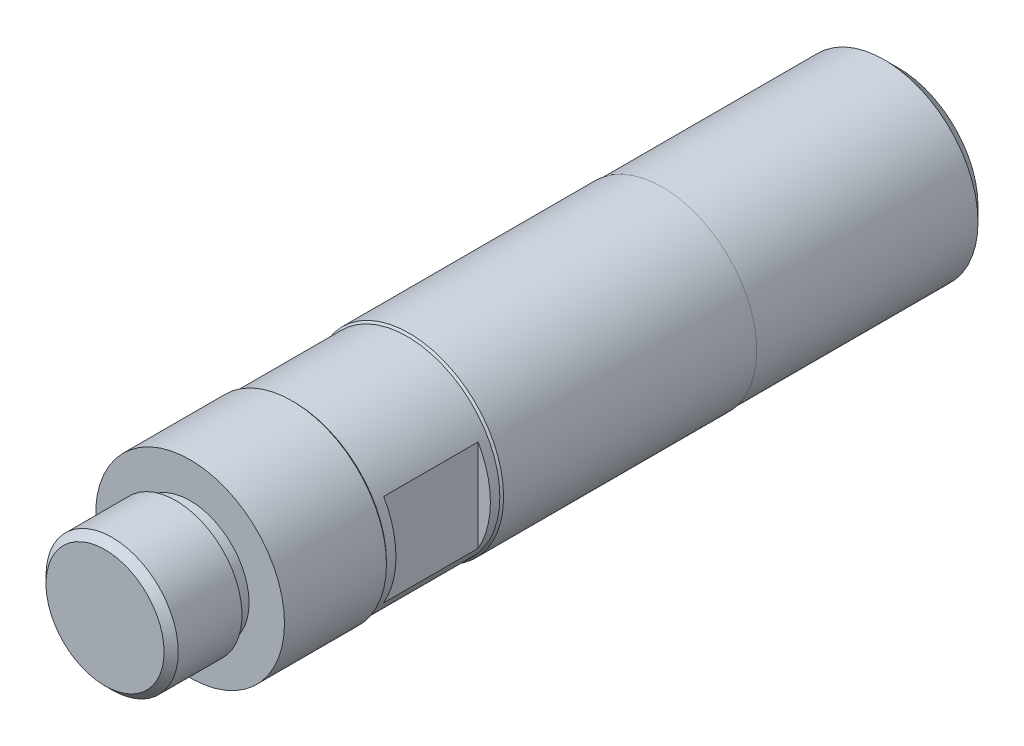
ISO-10303-21;
HEADER;
FILE_DESCRIPTION(('STEP AP214'),'2;1');
FILE_NAME('part.step','',(''),(''),'','','');
FILE_SCHEMA(('AUTOMOTIVE_DESIGN { 1 0 10303 214 1 1 1 1 }'));
ENDSEC;
DATA;
#1=APPLICATION_CONTEXT('core data for automotive mechanical design processes');
#2=APPLICATION_PROTOCOL_DEFINITION('international standard','automotive_design',2000,#1);
#3=PRODUCT_CONTEXT('',#1,'mechanical');
#4=PRODUCT('Part','Part','',(#3));
#5=PRODUCT_RELATED_PRODUCT_CATEGORY('part','',(#4));
#6=PRODUCT_DEFINITION_FORMATION('','',#4);
#7=PRODUCT_DEFINITION_CONTEXT('part definition',#1,'design');
#8=PRODUCT_DEFINITION('design','',#6,#7);
#9=PRODUCT_DEFINITION_SHAPE('','',#8);
#10=(LENGTH_UNIT() NAMED_UNIT(*) SI_UNIT(.MILLI.,.METRE.));
#11=(NAMED_UNIT(*) PLANE_ANGLE_UNIT() SI_UNIT($,.RADIAN.));
#12=(NAMED_UNIT(*) SI_UNIT($,.STERADIAN.) SOLID_ANGLE_UNIT());
#13=UNCERTAINTY_MEASURE_WITH_UNIT(LENGTH_MEASURE(1.E-05),#10,'distance_accuracy_value','');
#14=(GEOMETRIC_REPRESENTATION_CONTEXT(3) GLOBAL_UNCERTAINTY_ASSIGNED_CONTEXT((#13)) GLOBAL_UNIT_ASSIGNED_CONTEXT((#10,
#11,#12)) REPRESENTATION_CONTEXT('',''));
#15=CARTESIAN_POINT('',(0.,0.,0.));
#16=DIRECTION('',(0.,0.,1.));
#17=DIRECTION('',(1.,0.,0.));
#18=AXIS2_PLACEMENT_3D('',#15,#16,#17);
#19=CARTESIAN_POINT('',(0.,0.,75.));
#20=DIRECTION('',(0.,0.,-1.));
#21=DIRECTION('',(-1.,0.,0.));
#22=AXIS2_PLACEMENT_3D('',#19,#20,#21);
#23=CYLINDRICAL_SURFACE('',#22,10.);
#24=CARTESIAN_POINT('',(0.,0.,51.8));
#25=DIRECTION('',(0.,0.,1.));
#26=DIRECTION('',(1.,0.,0.));
#27=AXIS2_PLACEMENT_3D('',#24,#25,#26);
#28=CIRCLE('',#27,10.);
#29=CARTESIAN_POINT('',(10.,0.,51.8));
#30=VERTEX_POINT('',#29);
#31=EDGE_CURVE('E243',#30,#30,#28,.T.);
#32=ORIENTED_EDGE('',*,*,#31,.F.);
#33=EDGE_LOOP('',(#32));
#34=FACE_BOUND('',#33,.T.);
#35=CARTESIAN_POINT('',(0.,0.,25.));
#36=DIRECTION('',(0.,0.,1.));
#37=DIRECTION('',(1.,0.,0.));
#38=AXIS2_PLACEMENT_3D('',#35,#36,#37);
#39=CIRCLE('',#38,10.);
#40=CARTESIAN_POINT('',(10.,0.,25.));
#41=VERTEX_POINT('',#40);
#42=EDGE_CURVE('E251',#41,#41,#39,.T.);
#43=ORIENTED_EDGE('',*,*,#42,.T.);
#44=EDGE_LOOP('',(#43));
#45=FACE_BOUND('',#44,.T.);
#46=ADVANCED_FACE('F42',(#34,#45),#23,.T.);
#47=CARTESIAN_POINT('',(0.,0.,75.));
#48=DIRECTION('',(0.,0.,1.));
#49=DIRECTION('',(1.,0.,0.));
#50=AXIS2_PLACEMENT_3D('',#47,#48,#49);
#51=CIRCLE('',#50,10.);
#52=CARTESIAN_POINT('',(10.,0.,75.));
#53=VERTEX_POINT('',#52);
#54=EDGE_CURVE('E104',#53,#53,#51,.T.);
#55=ORIENTED_EDGE('',*,*,#54,.F.);
#56=EDGE_LOOP('',(#55));
#57=FACE_BOUND('',#56,.T.);
#58=CARTESIAN_POINT('',(0.,0.,64.2));
#59=DIRECTION('',(0.,0.,1.));
#60=DIRECTION('',(1.,0.,0.));
#61=AXIS2_PLACEMENT_3D('',#58,#59,#60);
#62=CIRCLE('',#61,10.);
#63=CARTESIAN_POINT('',(10.,0.,64.2));
#64=VERTEX_POINT('',#63);
#65=EDGE_CURVE('E100',#64,#64,#62,.T.);
#66=ORIENTED_EDGE('',*,*,#65,.T.);
#67=EDGE_LOOP('',(#66));
#68=FACE_BOUND('',#67,.T.);
#69=ADVANCED_FACE('F146',(#57,#68),#23,.T.);
#70=CARTESIAN_POINT('',(0.,0.,84.));
#71=DIRECTION('',(0.,0.,-1.));
#72=DIRECTION('',(-1.,0.,0.));
#73=AXIS2_PLACEMENT_3D('',#70,#71,#72);
#74=CYLINDRICAL_SURFACE('',#73,7.);
#75=CARTESIAN_POINT('',(0.,0.,83.25));
#76=DIRECTION('',(0.,0.,1.));
#77=DIRECTION('',(1.,0.,0.));
#78=AXIS2_PLACEMENT_3D('',#75,#76,#77);
#79=CIRCLE('',#78,7.);
#80=CARTESIAN_POINT('',(7.,0.,83.25));
#81=VERTEX_POINT('',#80);
#82=EDGE_CURVE('E93',#81,#81,#79,.F.);
#83=ORIENTED_EDGE('',*,*,#82,.T.);
#84=EDGE_LOOP('',(#83));
#85=FACE_BOUND('',#84,.T.);
#86=CARTESIAN_POINT('',(0.,0.,76.5));
#87=DIRECTION('',(0.,0.,-1.));
#88=DIRECTION('',(-1.,0.,0.));
#89=AXIS2_PLACEMENT_3D('',#86,#87,#88);
#90=CIRCLE('',#89,7.);
#91=CARTESIAN_POINT('',(-7.,0.,76.5));
#92=VERTEX_POINT('',#91);
#93=EDGE_CURVE('E122',#92,#92,#90,.T.);
#94=ORIENTED_EDGE('',*,*,#93,.F.);
#95=EDGE_LOOP('',(#94));
#96=FACE_BOUND('',#95,.T.);
#97=ADVANCED_FACE('F152',(#85,#96),#74,.T.);
#98=CARTESIAN_POINT('',(0.,0.,84.));
#99=DIRECTION('',(0.,0.,1.));
#100=DIRECTION('',(1.,0.,0.));
#101=AXIS2_PLACEMENT_3D('',#98,#99,#100);
#102=PLANE('',#101);
#103=CARTESIAN_POINT('',(0.,0.,84.));
#104=DIRECTION('',(0.,0.,1.));
#105=DIRECTION('',(1.,0.,0.));
#106=AXIS2_PLACEMENT_3D('',#103,#104,#105);
#107=CIRCLE('',#106,6.25);
#108=CARTESIAN_POINT('',(6.25,0.,84.));
#109=VERTEX_POINT('',#108);
#110=EDGE_CURVE('E110',#109,#109,#107,.T.);
#111=ORIENTED_EDGE('',*,*,#110,.T.);
#112=EDGE_LOOP('',(#111));
#113=FACE_BOUND('',#112,.T.);
#114=ADVANCED_FACE('F160',(#113),#102,.T.);
#115=CARTESIAN_POINT('',(0.,0.,84.));
#116=DIRECTION('',(0.,0.,-1.));
#117=DIRECTION('',(-1.,0.,0.));
#118=AXIS2_PLACEMENT_3D('',#115,#116,#117);
#119=CONICAL_SURFACE('',#118,6.25,0.785398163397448);
#120=ORIENTED_EDGE('',*,*,#82,.F.);
#121=EDGE_LOOP('',(#120));
#122=FACE_BOUND('',#121,.T.);
#123=ORIENTED_EDGE('',*,*,#110,.F.);
#124=EDGE_LOOP('',(#123));
#125=FACE_BOUND('',#124,.T.);
#126=ADVANCED_FACE('F157',(#122,#125),#119,.T.);
#127=CARTESIAN_POINT('',(-10.,0.,76.5));
#128=DIRECTION('',(0.,0.,-1.));
#129=DIRECTION('',(-1.,0.,0.));
#130=AXIS2_PLACEMENT_3D('',#127,#128,#129);
#131=PLANE('',#130);
#132=CARTESIAN_POINT('',(0.,0.,76.5));
#133=DIRECTION('',(0.,0.,1.));
#134=DIRECTION('',(1.,0.,0.));
#135=AXIS2_PLACEMENT_3D('',#132,#133,#134);
#136=CIRCLE('',#135,6.25);
#137=CARTESIAN_POINT('',(6.25,0.,76.5));
#138=VERTEX_POINT('',#137);
#139=EDGE_CURVE('E126',#138,#138,#136,.T.);
#140=ORIENTED_EDGE('',*,*,#139,.T.);
#141=EDGE_LOOP('',(#140));
#142=FACE_BOUND('',#141,.T.);
#143=ORIENTED_EDGE('',*,*,#93,.T.);
#144=EDGE_LOOP('',(#143));
#145=FACE_BOUND('',#144,.T.);
#146=ADVANCED_FACE('F159',(#142,#145),#131,.T.);
#147=CARTESIAN_POINT('',(0.,0.,83.9082113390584));
#148=DIRECTION('',(0.,0.,1.));
#149=DIRECTION('',(1.,0.,0.));
#150=AXIS2_PLACEMENT_3D('',#147,#148,#149);
#151=CYLINDRICAL_SURFACE('',#150,6.25);
#152=CARTESIAN_POINT('',(0.,0.,75.));
#153=DIRECTION('',(0.,0.,1.));
#154=DIRECTION('',(1.,0.,0.));
#155=AXIS2_PLACEMENT_3D('',#152,#153,#154);
#156=CIRCLE('',#155,6.25);
#157=CARTESIAN_POINT('',(6.25,0.,75.));
#158=VERTEX_POINT('',#157);
#159=EDGE_CURVE('E199',#158,#158,#156,.T.);
#160=ORIENTED_EDGE('',*,*,#159,.T.);
#161=EDGE_LOOP('',(#160));
#162=FACE_BOUND('',#161,.T.);
#163=ORIENTED_EDGE('',*,*,#139,.F.);
#164=EDGE_LOOP('',(#163));
#165=FACE_BOUND('',#164,.T.);
#166=ADVANCED_FACE('F166',(#162,#165),#151,.T.);
#167=CARTESIAN_POINT('',(0.,0.,75.));
#168=DIRECTION('',(0.,0.,1.));
#169=DIRECTION('',(1.,0.,0.));
#170=AXIS2_PLACEMENT_3D('',#167,#168,#169);
#171=PLANE('',#170);
#172=ORIENTED_EDGE('',*,*,#54,.T.);
#173=EDGE_LOOP('',(#172));
#174=FACE_BOUND('',#173,.T.);
#175=ORIENTED_EDGE('',*,*,#159,.F.);
#176=EDGE_LOOP('',(#175));
#177=FACE_BOUND('',#176,.T.);
#178=ADVANCED_FACE('F183',(#174,#177),#171,.T.);
#179=CARTESIAN_POINT('',(0.,0.,64.2));
#180=DIRECTION('',(0.,0.,1.));
#181=DIRECTION('',(1.,0.,0.));
#182=AXIS2_PLACEMENT_3D('',#179,#180,#181);
#183=CONICAL_SURFACE('',#182,10.,0.785398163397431);
#184=CARTESIAN_POINT('',(0.,0.,64.));
#185=DIRECTION('',(0.,0.,1.));
#186=DIRECTION('',(1.,0.,0.));
#187=AXIS2_PLACEMENT_3D('',#184,#185,#186);
#188=CIRCLE('',#187,9.8);
#189=CARTESIAN_POINT('',(9.8,0.,64.));
#190=VERTEX_POINT('',#189);
#191=EDGE_CURVE('E235',#190,#190,#188,.T.);
#192=ORIENTED_EDGE('',*,*,#191,.T.);
#193=EDGE_LOOP('',(#192));
#194=FACE_BOUND('',#193,.T.);
#195=ORIENTED_EDGE('',*,*,#65,.F.);
#196=EDGE_LOOP('',(#195));
#197=FACE_BOUND('',#196,.T.);
#198=ADVANCED_FACE('F185',(#194,#197),#183,.T.);
#199=CARTESIAN_POINT('',(0.,0.,84.));
#200=DIRECTION('',(0.,0.,1.));
#201=DIRECTION('',(1.,0.,0.));
#202=AXIS2_PLACEMENT_3D('',#199,#200,#201);
#203=CYLINDRICAL_SURFACE('',#202,9.8);
#204=DIRECTION('',(0.,0.,1.));
#205=VECTOR('',#204,1.);
#206=CARTESIAN_POINT('',(8.49999999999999,-4.8774993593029,84.));
#207=LINE('',#206,#205);
#208=CARTESIAN_POINT('',(8.49999999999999,-4.8774993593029,63.));
#209=VERTEX_POINT('',#208);
#210=CARTESIAN_POINT('',(8.49999999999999,-4.8774993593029,53.));
#211=VERTEX_POINT('',#210);
#212=EDGE_CURVE('E58',#209,#211,#207,.F.);
#213=ORIENTED_EDGE('',*,*,#212,.F.);
#214=CARTESIAN_POINT('',(0.,0.,63.));
#215=DIRECTION('',(0.,0.,-1.));
#216=DIRECTION('',(-1.,0.,0.));
#217=AXIS2_PLACEMENT_3D('',#214,#215,#216);
#218=CIRCLE('',#217,9.8);
#219=CARTESIAN_POINT('',(8.49999999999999,4.8774993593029,63.));
#220=VERTEX_POINT('',#219);
#221=EDGE_CURVE('E224',#220,#209,#218,.T.);
#222=ORIENTED_EDGE('',*,*,#221,.F.);
#223=DIRECTION('',(0.,0.,1.));
#224=VECTOR('',#223,1.);
#225=CARTESIAN_POINT('',(8.49999999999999,4.8774993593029,84.));
#226=LINE('',#225,#224);
#227=CARTESIAN_POINT('',(8.49999999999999,4.8774993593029,53.));
#228=VERTEX_POINT('',#227);
#229=EDGE_CURVE('E208',#228,#220,#226,.T.);
#230=ORIENTED_EDGE('',*,*,#229,.F.);
#231=CARTESIAN_POINT('',(0.,0.,53.));
#232=DIRECTION('',(0.,0.,1.));
#233=DIRECTION('',(1.,0.,0.));
#234=AXIS2_PLACEMENT_3D('',#231,#232,#233);
#235=CIRCLE('',#234,9.8);
#236=EDGE_CURVE('E201',#211,#228,#235,.T.);
#237=ORIENTED_EDGE('',*,*,#236,.F.);
#238=EDGE_LOOP('',(#213,#222,#230,#237));
#239=FACE_BOUND('',#238,.T.);
#240=CARTESIAN_POINT('',(0.,0.,53.));
#241=DIRECTION('',(0.,0.,1.));
#242=DIRECTION('',(1.,0.,0.));
#243=AXIS2_PLACEMENT_3D('',#240,#241,#242);
#244=CIRCLE('',#243,9.8);
#245=CARTESIAN_POINT('',(-8.49999999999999,4.8774993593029,53.));
#246=VERTEX_POINT('',#245);
#247=CARTESIAN_POINT('',(-8.49999999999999,-4.87749935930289,53.));
#248=VERTEX_POINT('',#247);
#249=EDGE_CURVE('E66',#246,#248,#244,.T.);
#250=ORIENTED_EDGE('',*,*,#249,.F.);
#251=DIRECTION('',(0.,0.,1.));
#252=VECTOR('',#251,1.);
#253=CARTESIAN_POINT('',(-8.49999999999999,4.8774993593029,84.));
#254=LINE('',#253,#252);
#255=CARTESIAN_POINT('',(-8.49999999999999,4.8774993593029,63.));
#256=VERTEX_POINT('',#255);
#257=EDGE_CURVE('E81',#256,#246,#254,.F.);
#258=ORIENTED_EDGE('',*,*,#257,.F.);
#259=CARTESIAN_POINT('',(0.,0.,63.));
#260=DIRECTION('',(0.,0.,-1.));
#261=DIRECTION('',(-1.,0.,0.));
#262=AXIS2_PLACEMENT_3D('',#259,#260,#261);
#263=CIRCLE('',#262,9.8);
#264=CARTESIAN_POINT('',(-8.49999999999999,-4.8774993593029,63.));
#265=VERTEX_POINT('',#264);
#266=EDGE_CURVE('E85',#265,#256,#263,.T.);
#267=ORIENTED_EDGE('',*,*,#266,.F.);
#268=DIRECTION('',(0.,0.,1.));
#269=VECTOR('',#268,1.);
#270=CARTESIAN_POINT('',(-8.49999999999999,-4.8774993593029,84.));
#271=LINE('',#270,#269);
#272=EDGE_CURVE('E92',#248,#265,#271,.T.);
#273=ORIENTED_EDGE('',*,*,#272,.F.);
#274=EDGE_LOOP('',(#250,#258,#267,#273));
#275=FACE_BOUND('',#274,.T.);
#276=CARTESIAN_POINT('',(0.,0.,52.));
#277=DIRECTION('',(0.,0.,1.));
#278=DIRECTION('',(1.,0.,0.));
#279=AXIS2_PLACEMENT_3D('',#276,#277,#278);
#280=CIRCLE('',#279,9.8);
#281=CARTESIAN_POINT('',(9.8,0.,52.));
#282=VERTEX_POINT('',#281);
#283=EDGE_CURVE('E239',#282,#282,#280,.T.);
#284=ORIENTED_EDGE('',*,*,#283,.T.);
#285=EDGE_LOOP('',(#284));
#286=FACE_BOUND('',#285,.T.);
#287=ORIENTED_EDGE('',*,*,#191,.F.);
#288=EDGE_LOOP('',(#287));
#289=FACE_BOUND('',#288,.T.);
#290=ADVANCED_FACE('F83',(#239,#275,#286,#289),#203,.T.);
#291=CARTESIAN_POINT('',(0.,0.,52.));
#292=DIRECTION('',(0.,0.,-1.));
#293=DIRECTION('',(-1.,0.,0.));
#294=AXIS2_PLACEMENT_3D('',#291,#292,#293);
#295=CONICAL_SURFACE('',#294,9.8,0.785398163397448);
#296=ORIENTED_EDGE('',*,*,#31,.T.);
#297=EDGE_LOOP('',(#296));
#298=FACE_BOUND('',#297,.T.);
#299=ORIENTED_EDGE('',*,*,#283,.F.);
#300=EDGE_LOOP('',(#299));
#301=FACE_BOUND('',#300,.T.);
#302=ADVANCED_FACE('F267',(#298,#301),#295,.T.);
#303=CARTESIAN_POINT('',(-8.49999999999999,19.5,53.));
#304=DIRECTION('',(-1.,0.,0.));
#305=DIRECTION('',(0.,0.,1.));
#306=AXIS2_PLACEMENT_3D('',#303,#304,#305);
#307=PLANE('',#306);
#308=DIRECTION('',(0.,-1.,0.));
#309=VECTOR('',#308,1.);
#310=CARTESIAN_POINT('',(-8.49999999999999,19.5,53.));
#311=LINE('',#310,#309);
#312=EDGE_CURVE('E105',#246,#248,#311,.T.);
#313=ORIENTED_EDGE('',*,*,#312,.T.);
#314=ORIENTED_EDGE('',*,*,#272,.T.);
#315=DIRECTION('',(0.,-1.,0.));
#316=VECTOR('',#315,1.);
#317=CARTESIAN_POINT('',(-8.49999999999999,19.5,63.));
#318=LINE('',#317,#316);
#319=EDGE_CURVE('E98',#256,#265,#318,.T.);
#320=ORIENTED_EDGE('',*,*,#319,.F.);
#321=ORIENTED_EDGE('',*,*,#257,.T.);
#322=EDGE_LOOP('',(#313,#314,#320,#321));
#323=FACE_BOUND('',#322,.T.);
#324=ADVANCED_FACE('F102',(#323),#307,.T.);
#325=CARTESIAN_POINT('',(-10.,19.5,63.));
#326=DIRECTION('',(0.,0.,-1.));
#327=DIRECTION('',(-1.,0.,0.));
#328=AXIS2_PLACEMENT_3D('',#325,#326,#327);
#329=PLANE('',#328);
#330=ORIENTED_EDGE('',*,*,#319,.T.);
#331=ORIENTED_EDGE('',*,*,#266,.T.);
#332=EDGE_LOOP('',(#330,#331));
#333=FACE_BOUND('',#332,.T.);
#334=ADVANCED_FACE('F97',(#333),#329,.T.);
#335=CARTESIAN_POINT('',(-10.,19.5,53.));
#336=DIRECTION('',(0.,0.,1.));
#337=DIRECTION('',(1.,0.,0.));
#338=AXIS2_PLACEMENT_3D('',#335,#336,#337);
#339=PLANE('',#338);
#340=ORIENTED_EDGE('',*,*,#312,.F.);
#341=ORIENTED_EDGE('',*,*,#249,.T.);
#342=EDGE_LOOP('',(#340,#341));
#343=FACE_BOUND('',#342,.T.);
#344=ADVANCED_FACE('F276',(#343),#339,.T.);
#345=CARTESIAN_POINT('',(10.,19.5,63.));
#346=DIRECTION('',(0.,0.,-1.));
#347=DIRECTION('',(-1.,0.,0.));
#348=AXIS2_PLACEMENT_3D('',#345,#346,#347);
#349=PLANE('',#348);
#350=DIRECTION('',(0.,-1.,0.));
#351=VECTOR('',#350,1.);
#352=CARTESIAN_POINT('',(8.49999999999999,19.5,63.));
#353=LINE('',#352,#351);
#354=EDGE_CURVE('E125',#220,#209,#353,.T.);
#355=ORIENTED_EDGE('',*,*,#354,.F.);
#356=ORIENTED_EDGE('',*,*,#221,.T.);
#357=EDGE_LOOP('',(#355,#356));
#358=FACE_BOUND('',#357,.T.);
#359=ADVANCED_FACE('F273',(#358),#349,.T.);
#360=CARTESIAN_POINT('',(8.49999999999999,19.5,53.));
#361=DIRECTION('',(1.,0.,0.));
#362=DIRECTION('',(0.,0.,-1.));
#363=AXIS2_PLACEMENT_3D('',#360,#361,#362);
#364=PLANE('',#363);
#365=DIRECTION('',(0.,-1.,0.));
#366=VECTOR('',#365,1.);
#367=CARTESIAN_POINT('',(8.49999999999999,19.5,53.));
#368=LINE('',#367,#366);
#369=EDGE_CURVE('E112',#228,#211,#368,.T.);
#370=ORIENTED_EDGE('',*,*,#369,.F.);
#371=ORIENTED_EDGE('',*,*,#229,.T.);
#372=ORIENTED_EDGE('',*,*,#354,.T.);
#373=ORIENTED_EDGE('',*,*,#212,.T.);
#374=EDGE_LOOP('',(#370,#371,#372,#373));
#375=FACE_BOUND('',#374,.T.);
#376=ADVANCED_FACE('F221',(#375),#364,.T.);
#377=CARTESIAN_POINT('',(10.,19.5,53.));
#378=DIRECTION('',(0.,0.,1.));
#379=DIRECTION('',(1.,0.,0.));
#380=AXIS2_PLACEMENT_3D('',#377,#378,#379);
#381=PLANE('',#380);
#382=ORIENTED_EDGE('',*,*,#369,.T.);
#383=ORIENTED_EDGE('',*,*,#236,.T.);
#384=EDGE_LOOP('',(#382,#383));
#385=FACE_BOUND('',#384,.T.);
#386=ADVANCED_FACE('F218',(#385),#381,.T.);
#387=CARTESIAN_POINT('',(0.,10.,25.));
#388=DIRECTION('',(0.,0.,-1.));
#389=DIRECTION('',(-1.,0.,0.));
#390=AXIS2_PLACEMENT_3D('',#387,#388,#389);
#391=PLANE('',#390);
#392=CARTESIAN_POINT('',(0.,0.,25.));
#393=DIRECTION('',(0.,0.,1.));
#394=DIRECTION('',(1.,0.,0.));
#395=AXIS2_PLACEMENT_3D('',#392,#393,#394);
#396=CIRCLE('',#395,9.925);
#397=CARTESIAN_POINT('',(9.925,0.,25.));
#398=VERTEX_POINT('',#397);
#399=EDGE_CURVE('E247',#398,#398,#396,.T.);
#400=ORIENTED_EDGE('',*,*,#399,.T.);
#401=EDGE_LOOP('',(#400));
#402=FACE_BOUND('',#401,.T.);
#403=ORIENTED_EDGE('',*,*,#42,.F.);
#404=EDGE_LOOP('',(#403));
#405=FACE_BOUND('',#404,.T.);
#406=ADVANCED_FACE('F256',(#402,#405),#391,.T.);
#407=CARTESIAN_POINT('',(0.,0.,84.));
#408=DIRECTION('',(0.,0.,1.));
#409=DIRECTION('',(1.,0.,0.));
#410=AXIS2_PLACEMENT_3D('',#407,#408,#409);
#411=CYLINDRICAL_SURFACE('',#410,9.925);
#412=CARTESIAN_POINT('',(0.,0.,1.5));
#413=DIRECTION('',(0.,0.,1.));
#414=DIRECTION('',(1.,0.,0.));
#415=AXIS2_PLACEMENT_3D('',#412,#413,#414);
#416=CIRCLE('',#415,9.925);
#417=CARTESIAN_POINT('',(9.925,0.,1.5));
#418=VERTEX_POINT('',#417);
#419=EDGE_CURVE('E51',#418,#418,#416,.T.);
#420=ORIENTED_EDGE('',*,*,#419,.T.);
#421=EDGE_LOOP('',(#420));
#422=FACE_BOUND('',#421,.T.);
#423=ORIENTED_EDGE('',*,*,#399,.F.);
#424=EDGE_LOOP('',(#423));
#425=FACE_BOUND('',#424,.T.);
#426=ADVANCED_FACE('F133',(#422,#425),#411,.T.);
#427=CARTESIAN_POINT('',(0.,0.,0.));
#428=DIRECTION('',(0.,0.,1.));
#429=DIRECTION('',(1.,0.,0.));
#430=AXIS2_PLACEMENT_3D('',#427,#428,#429);
#431=PLANE('',#430);
#432=CARTESIAN_POINT('',(0.,0.,0.));
#433=DIRECTION('',(0.,0.,1.));
#434=DIRECTION('',(1.,0.,0.));
#435=AXIS2_PLACEMENT_3D('',#432,#433,#434);
#436=CIRCLE('',#435,8.425);
#437=CARTESIAN_POINT('',(8.425,0.,0.));
#438=VERTEX_POINT('',#437);
#439=EDGE_CURVE('E11',#438,#438,#436,.F.);
#440=ORIENTED_EDGE('',*,*,#439,.T.);
#441=EDGE_LOOP('',(#440));
#442=FACE_BOUND('',#441,.T.);
#443=ADVANCED_FACE('F137',(#442),#431,.F.);
#444=CARTESIAN_POINT('',(0.,0.,1.5));
#445=DIRECTION('',(0.,0.,1.));
#446=DIRECTION('',(1.,0.,0.));
#447=AXIS2_PLACEMENT_3D('',#444,#445,#446);
#448=CONICAL_SURFACE('',#447,9.925,0.785398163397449);
#449=ORIENTED_EDGE('',*,*,#439,.F.);
#450=EDGE_LOOP('',(#449));
#451=FACE_BOUND('',#450,.T.);
#452=ORIENTED_EDGE('',*,*,#419,.F.);
#453=EDGE_LOOP('',(#452));
#454=FACE_BOUND('',#453,.T.);
#455=ADVANCED_FACE('F44',(#451,#454),#448,.T.);
#456=CLOSED_SHELL('',(#46,#69,#97,#114,#126,#146,#166,#178,#198,#290,#302,#324,#334,#344,#359,
#376,#386,#406,#426,#443,#455));
#457=MANIFOLD_SOLID_BREP('B2',#456);
#458=ADVANCED_BREP_SHAPE_REPRESENTATION('',(#18,#457),#14);
#459=SHAPE_DEFINITION_REPRESENTATION(#9,#458);
ENDSEC;
END-ISO-10303-21;
